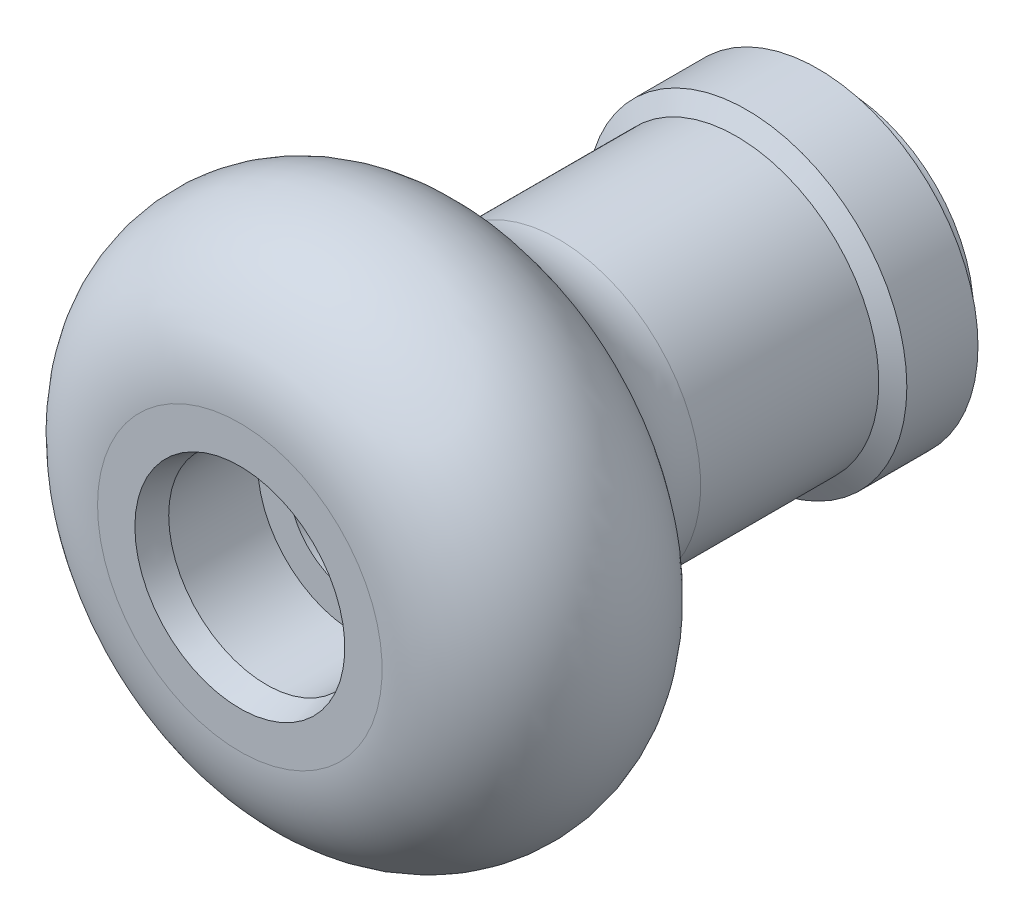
ISO-10303-21;
HEADER;
FILE_DESCRIPTION(('STEP AP214'),'2;1');
FILE_NAME('part.step','',(''),(''),'','','');
FILE_SCHEMA(('AUTOMOTIVE_DESIGN { 1 0 10303 214 1 1 1 1 }'));
ENDSEC;
DATA;
#1=APPLICATION_CONTEXT('core data for automotive mechanical design processes');
#2=APPLICATION_PROTOCOL_DEFINITION('international standard','automotive_design',2000,#1);
#3=PRODUCT_CONTEXT('',#1,'mechanical');
#4=PRODUCT('Part','Part','',(#3));
#5=PRODUCT_RELATED_PRODUCT_CATEGORY('part','',(#4));
#6=PRODUCT_DEFINITION_FORMATION('','',#4);
#7=PRODUCT_DEFINITION_CONTEXT('part definition',#1,'design');
#8=PRODUCT_DEFINITION('design','',#6,#7);
#9=PRODUCT_DEFINITION_SHAPE('','',#8);
#10=(LENGTH_UNIT() NAMED_UNIT(*) SI_UNIT(.MILLI.,.METRE.));
#11=(NAMED_UNIT(*) PLANE_ANGLE_UNIT() SI_UNIT($,.RADIAN.));
#12=(NAMED_UNIT(*) SI_UNIT($,.STERADIAN.) SOLID_ANGLE_UNIT());
#13=UNCERTAINTY_MEASURE_WITH_UNIT(LENGTH_MEASURE(1.E-05),#10,'distance_accuracy_value','');
#14=(GEOMETRIC_REPRESENTATION_CONTEXT(3) GLOBAL_UNCERTAINTY_ASSIGNED_CONTEXT((#13)) GLOBAL_UNIT_ASSIGNED_CONTEXT((#10,
#11,#12)) REPRESENTATION_CONTEXT('',''));
#15=CARTESIAN_POINT('',(0.,0.,0.));
#16=DIRECTION('',(0.,0.,1.));
#17=DIRECTION('',(1.,0.,0.));
#18=AXIS2_PLACEMENT_3D('',#15,#16,#17);
#19=CARTESIAN_POINT('',(0.,18.,3.));
#20=DIRECTION('',(0.,0.,1.));
#21=DIRECTION('',(1.,0.,0.));
#22=AXIS2_PLACEMENT_3D('',#19,#20,#21);
#23=PLANE('',#22);
#24=CARTESIAN_POINT('',(0.,0.,3.));
#25=DIRECTION('',(0.,0.,-1.));
#26=DIRECTION('',(-1.,0.,0.));
#27=AXIS2_PLACEMENT_3D('',#24,#25,#26);
#28=CIRCLE('',#27,16.9994116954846);
#29=CARTESIAN_POINT('',(-16.9994116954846,0.,3.));
#30=VERTEX_POINT('',#29);
#31=EDGE_CURVE('E8',#30,#30,#28,.T.);
#32=ORIENTED_EDGE('',*,*,#31,.F.);
#33=EDGE_LOOP('',(#32));
#34=FACE_BOUND('',#33,.T.);
#35=CARTESIAN_POINT('',(0.,0.,3.));
#36=DIRECTION('',(0.,0.,-1.));
#37=DIRECTION('',(-1.,0.,0.));
#38=AXIS2_PLACEMENT_3D('',#35,#36,#37);
#39=CIRCLE('',#38,18.);
#40=CARTESIAN_POINT('',(-18.,0.,3.));
#41=VERTEX_POINT('',#40);
#42=EDGE_CURVE('E55',#41,#41,#39,.T.);
#43=ORIENTED_EDGE('',*,*,#42,.T.);
#44=EDGE_LOOP('',(#43));
#45=FACE_BOUND('',#44,.T.);
#46=ADVANCED_FACE('F12',(#34,#45),#23,.F.);
#47=CARTESIAN_POINT('',(0.,0.,0.0420098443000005));
#48=DIRECTION('',(0.,0.,-1.));
#49=DIRECTION('',(-1.,0.,0.));
#50=AXIS2_PLACEMENT_3D('',#47,#48,#49);
#51=TOROIDAL_SURFACE('',#50,17.4997058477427,3.);
#52=ORIENTED_EDGE('',*,*,#31,.T.);
#53=EDGE_LOOP('',(#52));
#54=FACE_BOUND('',#53,.T.);
#55=CARTESIAN_POINT('',(0.,0.,0.));
#56=DIRECTION('',(0.,0.,-1.));
#57=DIRECTION('',(-1.,0.,0.));
#58=AXIS2_PLACEMENT_3D('',#55,#56,#57);
#59=CIRCLE('',#58,14.5);
#60=CARTESIAN_POINT('',(-14.5,0.,0.));
#61=VERTEX_POINT('',#60);
#62=EDGE_CURVE('E18',#61,#61,#59,.T.);
#63=ORIENTED_EDGE('',*,*,#62,.F.);
#64=EDGE_LOOP('',(#63));
#65=FACE_BOUND('',#64,.T.);
#66=ADVANCED_FACE('F74',(#54,#65),#51,.F.);
#67=CARTESIAN_POINT('',(0.,14.5,0.));
#68=DIRECTION('',(0.,0.,1.));
#69=DIRECTION('',(1.,0.,0.));
#70=AXIS2_PLACEMENT_3D('',#67,#68,#69);
#71=PLANE('',#70);
#72=CARTESIAN_POINT('',(0.,0.,0.));
#73=DIRECTION('',(0.,0.,-1.));
#74=DIRECTION('',(-1.,0.,0.));
#75=AXIS2_PLACEMENT_3D('',#72,#73,#74);
#76=CIRCLE('',#75,7.5);
#77=CARTESIAN_POINT('',(-7.5,0.,0.));
#78=VERTEX_POINT('',#77);
#79=EDGE_CURVE('E22',#78,#78,#76,.T.);
#80=ORIENTED_EDGE('',*,*,#79,.F.);
#81=EDGE_LOOP('',(#80));
#82=FACE_BOUND('',#81,.T.);
#83=ORIENTED_EDGE('',*,*,#62,.T.);
#84=EDGE_LOOP('',(#83));
#85=FACE_BOUND('',#84,.T.);
#86=ADVANCED_FACE('F80',(#82,#85),#71,.F.);
#87=CARTESIAN_POINT('',(0.,0.,-5.));
#88=DIRECTION('',(0.,0.,-1.));
#89=DIRECTION('',(-1.,0.,0.));
#90=AXIS2_PLACEMENT_3D('',#87,#88,#89);
#91=CYLINDRICAL_SURFACE('',#90,7.5);
#92=CARTESIAN_POINT('',(0.,0.,55.));
#93=DIRECTION('',(0.,0.,-1.));
#94=DIRECTION('',(-1.,0.,0.));
#95=AXIS2_PLACEMENT_3D('',#92,#93,#94);
#96=CIRCLE('',#95,7.5);
#97=CARTESIAN_POINT('',(-7.5,0.,55.));
#98=VERTEX_POINT('',#97);
#99=EDGE_CURVE('E26',#98,#98,#96,.T.);
#100=ORIENTED_EDGE('',*,*,#99,.F.);
#101=EDGE_LOOP('',(#100));
#102=FACE_BOUND('',#101,.T.);
#103=ORIENTED_EDGE('',*,*,#79,.T.);
#104=EDGE_LOOP('',(#103));
#105=FACE_BOUND('',#104,.T.);
#106=ADVANCED_FACE('F85',(#102,#105),#91,.F.);
#107=CARTESIAN_POINT('',(0.,7.5,55.));
#108=DIRECTION('',(0.,0.,-1.));
#109=DIRECTION('',(-1.,0.,0.));
#110=AXIS2_PLACEMENT_3D('',#107,#108,#109);
#111=PLANE('',#110);
#112=CARTESIAN_POINT('',(0.,0.,55.));
#113=DIRECTION('',(0.,0.,-1.));
#114=DIRECTION('',(-1.,0.,0.));
#115=AXIS2_PLACEMENT_3D('',#112,#113,#114);
#116=CIRCLE('',#115,11.);
#117=CARTESIAN_POINT('',(-11.,0.,55.));
#118=VERTEX_POINT('',#117);
#119=EDGE_CURVE('E31',#118,#118,#116,.T.);
#120=ORIENTED_EDGE('',*,*,#119,.F.);
#121=EDGE_LOOP('',(#120));
#122=FACE_BOUND('',#121,.T.);
#123=ORIENTED_EDGE('',*,*,#99,.T.);
#124=EDGE_LOOP('',(#123));
#125=FACE_BOUND('',#124,.T.);
#126=ADVANCED_FACE('F92',(#122,#125),#111,.F.);
#127=CARTESIAN_POINT('',(0.,0.,-5.));
#128=DIRECTION('',(0.,0.,-1.));
#129=DIRECTION('',(-1.,0.,0.));
#130=AXIS2_PLACEMENT_3D('',#127,#128,#129);
#131=CYLINDRICAL_SURFACE('',#130,11.);
#132=CARTESIAN_POINT('',(0.,0.,65.));
#133=DIRECTION('',(0.,0.,-1.));
#134=DIRECTION('',(-1.,0.,0.));
#135=AXIS2_PLACEMENT_3D('',#132,#133,#134);
#136=CIRCLE('',#135,11.);
#137=CARTESIAN_POINT('',(-11.,0.,65.));
#138=VERTEX_POINT('',#137);
#139=EDGE_CURVE('E34',#138,#138,#136,.T.);
#140=ORIENTED_EDGE('',*,*,#139,.F.);
#141=EDGE_LOOP('',(#140));
#142=FACE_BOUND('',#141,.T.);
#143=ORIENTED_EDGE('',*,*,#119,.T.);
#144=EDGE_LOOP('',(#143));
#145=FACE_BOUND('',#144,.T.);
#146=ADVANCED_FACE('F96',(#142,#145),#131,.F.);
#147=CARTESIAN_POINT('',(0.,0.,65.));
#148=DIRECTION('',(0.,0.,1.));
#149=DIRECTION('',(1.,0.,0.));
#150=AXIS2_PLACEMENT_3D('',#147,#148,#149);
#151=CONICAL_SURFACE('',#150,11.,0.261799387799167);
#152=CARTESIAN_POINT('',(0.,0.,68.));
#153=DIRECTION('',(0.,0.,-1.));
#154=DIRECTION('',(-1.,0.,0.));
#155=AXIS2_PLACEMENT_3D('',#152,#153,#154);
#156=CIRCLE('',#155,11.8038475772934);
#157=CARTESIAN_POINT('',(-11.8038475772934,0.,68.));
#158=VERTEX_POINT('',#157);
#159=EDGE_CURVE('E37',#158,#158,#156,.T.);
#160=ORIENTED_EDGE('',*,*,#159,.F.);
#161=EDGE_LOOP('',(#160));
#162=FACE_BOUND('',#161,.T.);
#163=ORIENTED_EDGE('',*,*,#139,.T.);
#164=EDGE_LOOP('',(#163));
#165=FACE_BOUND('',#164,.T.);
#166=ADVANCED_FACE('F100',(#162,#165),#151,.F.);
#167=CARTESIAN_POINT('',(0.,16.,68.));
#168=DIRECTION('',(0.,0.,1.));
#169=DIRECTION('',(1.,0.,0.));
#170=AXIS2_PLACEMENT_3D('',#167,#168,#169);
#171=PLANE('',#170);
#172=ORIENTED_EDGE('',*,*,#159,.T.);
#173=EDGE_LOOP('',(#172));
#174=FACE_BOUND('',#173,.T.);
#175=CARTESIAN_POINT('',(0.,0.,68.));
#176=DIRECTION('',(0.,0.,-1.));
#177=DIRECTION('',(-1.,0.,0.));
#178=AXIS2_PLACEMENT_3D('',#175,#176,#177);
#179=CIRCLE('',#178,16.);
#180=CARTESIAN_POINT('',(-16.,0.,68.));
#181=VERTEX_POINT('',#180);
#182=EDGE_CURVE('E40',#181,#181,#179,.T.);
#183=ORIENTED_EDGE('',*,*,#182,.F.);
#184=EDGE_LOOP('',(#183));
#185=FACE_BOUND('',#184,.T.);
#186=ADVANCED_FACE('F104',(#174,#185),#171,.T.);
#187=CARTESIAN_POINT('',(0.,0.,54.));
#188=DIRECTION('',(0.,0.,-1.));
#189=DIRECTION('',(-1.,0.,0.));
#190=AXIS2_PLACEMENT_3D('',#187,#188,#189);
#191=TOROIDAL_SURFACE('',#190,16.,14.);
#192=CARTESIAN_POINT('',(0.,0.,41.273169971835));
#193=DIRECTION('',(0.,0.,-1.));
#194=DIRECTION('',(-1.,0.,0.));
#195=AXIS2_PLACEMENT_3D('',#192,#193,#194);
#196=CIRCLE('',#195,21.8333350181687);
#197=CARTESIAN_POINT('',(-21.8333350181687,0.,41.273169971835));
#198=VERTEX_POINT('',#197);
#199=EDGE_CURVE('E43',#198,#198,#196,.T.);
#200=ORIENTED_EDGE('',*,*,#199,.F.);
#201=EDGE_LOOP('',(#200));
#202=FACE_BOUND('',#201,.T.);
#203=ORIENTED_EDGE('',*,*,#182,.T.);
#204=EDGE_LOOP('',(#203));
#205=FACE_BOUND('',#204,.T.);
#206=ADVANCED_FACE('F108',(#202,#205),#191,.T.);
#207=CARTESIAN_POINT('',(0.,0.,32.182575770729));
#208=DIRECTION('',(0.,0.,-1.));
#209=DIRECTION('',(-1.,0.,0.));
#210=AXIS2_PLACEMENT_3D('',#207,#208,#209);
#211=TOROIDAL_SURFACE('',#210,26.,10.0000000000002);
#212=ORIENTED_EDGE('',*,*,#199,.T.);
#213=EDGE_LOOP('',(#212));
#214=FACE_BOUND('',#213,.T.);
#215=CARTESIAN_POINT('',(0.,0.,32.1825784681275));
#216=DIRECTION('',(0.,0.,-1.));
#217=DIRECTION('',(-1.,0.,0.));
#218=AXIS2_PLACEMENT_3D('',#215,#216,#217);
#219=CIRCLE('',#218,16.);
#220=CARTESIAN_POINT('',(-16.,0.,32.1825784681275));
#221=VERTEX_POINT('',#220);
#222=EDGE_CURVE('E46',#221,#221,#219,.T.);
#223=ORIENTED_EDGE('',*,*,#222,.F.);
#224=EDGE_LOOP('',(#223));
#225=FACE_BOUND('',#224,.T.);
#226=ADVANCED_FACE('F112',(#214,#225),#211,.F.);
#227=CARTESIAN_POINT('',(0.,0.,-5.));
#228=DIRECTION('',(0.,0.,-1.));
#229=DIRECTION('',(-1.,0.,0.));
#230=AXIS2_PLACEMENT_3D('',#227,#228,#229);
#231=CYLINDRICAL_SURFACE('',#230,16.);
#232=CARTESIAN_POINT('',(0.,0.,12.1547005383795));
#233=DIRECTION('',(0.,0.,-1.));
#234=DIRECTION('',(-1.,0.,0.));
#235=AXIS2_PLACEMENT_3D('',#232,#233,#234);
#236=CIRCLE('',#235,16.);
#237=CARTESIAN_POINT('',(-16.,0.,12.1547005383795));
#238=VERTEX_POINT('',#237);
#239=EDGE_CURVE('E49',#238,#238,#236,.T.);
#240=ORIENTED_EDGE('',*,*,#239,.F.);
#241=EDGE_LOOP('',(#240));
#242=FACE_BOUND('',#241,.T.);
#243=ORIENTED_EDGE('',*,*,#222,.T.);
#244=EDGE_LOOP('',(#243));
#245=FACE_BOUND('',#244,.T.);
#246=ADVANCED_FACE('F70',(#242,#245),#231,.T.);
#247=CARTESIAN_POINT('',(0.,0.,11.));
#248=DIRECTION('',(0.,0.,-1.));
#249=DIRECTION('',(-1.,0.,0.));
#250=AXIS2_PLACEMENT_3D('',#247,#248,#249);
#251=CONICAL_SURFACE('',#250,18.,1.0471975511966);
#252=ORIENTED_EDGE('',*,*,#239,.T.);
#253=EDGE_LOOP('',(#252));
#254=FACE_BOUND('',#253,.T.);
#255=CARTESIAN_POINT('',(0.,0.,11.));
#256=DIRECTION('',(0.,0.,-1.));
#257=DIRECTION('',(-1.,0.,0.));
#258=AXIS2_PLACEMENT_3D('',#255,#256,#257);
#259=CIRCLE('',#258,18.);
#260=CARTESIAN_POINT('',(-18.,0.,11.));
#261=VERTEX_POINT('',#260);
#262=EDGE_CURVE('E52',#261,#261,#259,.T.);
#263=ORIENTED_EDGE('',*,*,#262,.F.);
#264=EDGE_LOOP('',(#263));
#265=FACE_BOUND('',#264,.T.);
#266=ADVANCED_FACE('F62',(#254,#265),#251,.T.);
#267=CARTESIAN_POINT('',(0.,0.,-5.));
#268=DIRECTION('',(0.,0.,-1.));
#269=DIRECTION('',(-1.,0.,0.));
#270=AXIS2_PLACEMENT_3D('',#267,#268,#269);
#271=CYLINDRICAL_SURFACE('',#270,18.);
#272=ORIENTED_EDGE('',*,*,#262,.T.);
#273=EDGE_LOOP('',(#272));
#274=FACE_BOUND('',#273,.T.);
#275=ORIENTED_EDGE('',*,*,#42,.F.);
#276=EDGE_LOOP('',(#275));
#277=FACE_BOUND('',#276,.T.);
#278=ADVANCED_FACE('F60',(#274,#277),#271,.T.);
#279=CLOSED_SHELL('',(#46,#66,#86,#106,#126,#146,#166,#186,#206,#226,#246,#266,#278));
#280=MANIFOLD_SOLID_BREP('B1',#279);
#281=ADVANCED_BREP_SHAPE_REPRESENTATION('',(#18,#280),#14);
#282=SHAPE_DEFINITION_REPRESENTATION(#9,#281);
ENDSEC;
END-ISO-10303-21;
